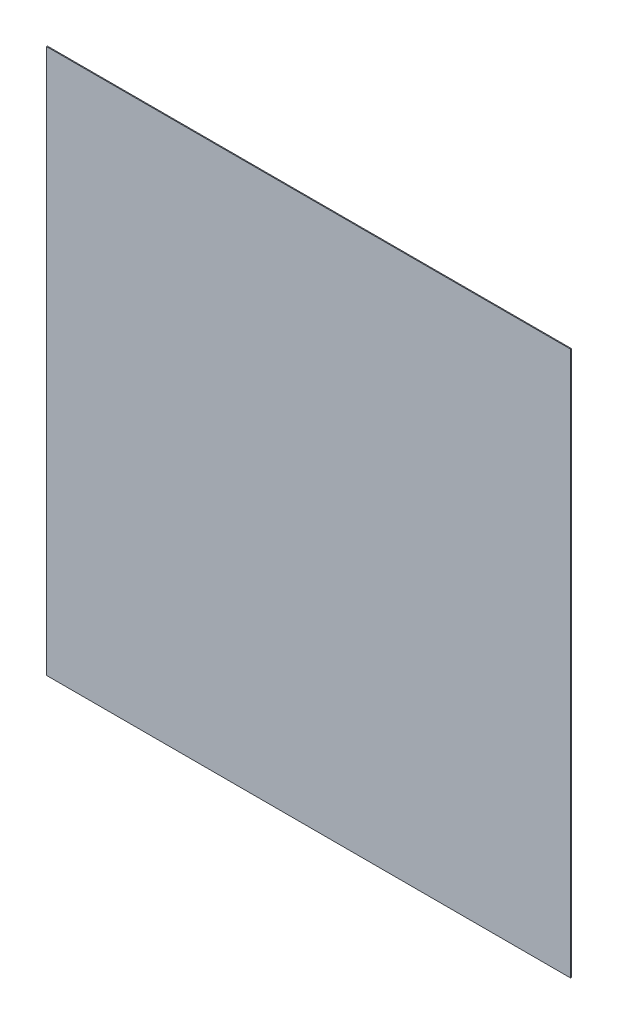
ISO-10303-21;
HEADER;
FILE_DESCRIPTION(('STEP AP214'),'2;1');
FILE_NAME('part.step','',(''),(''),'','','');
FILE_SCHEMA(('AUTOMOTIVE_DESIGN { 1 0 10303 214 1 1 1 1 }'));
ENDSEC;
DATA;
#1=APPLICATION_CONTEXT('core data for automotive mechanical design processes');
#2=APPLICATION_PROTOCOL_DEFINITION('international standard','automotive_design',2000,#1);
#3=PRODUCT_CONTEXT('',#1,'mechanical');
#4=PRODUCT('Part','Part','',(#3));
#5=PRODUCT_RELATED_PRODUCT_CATEGORY('part','',(#4));
#6=PRODUCT_DEFINITION_FORMATION('','',#4);
#7=PRODUCT_DEFINITION_CONTEXT('part definition',#1,'design');
#8=PRODUCT_DEFINITION('design','',#6,#7);
#9=PRODUCT_DEFINITION_SHAPE('','',#8);
#10=(LENGTH_UNIT() NAMED_UNIT(*) SI_UNIT(.MILLI.,.METRE.));
#11=(NAMED_UNIT(*) PLANE_ANGLE_UNIT() SI_UNIT($,.RADIAN.));
#12=(NAMED_UNIT(*) SI_UNIT($,.STERADIAN.) SOLID_ANGLE_UNIT());
#13=UNCERTAINTY_MEASURE_WITH_UNIT(LENGTH_MEASURE(1.E-05),#10,'distance_accuracy_value','');
#14=(GEOMETRIC_REPRESENTATION_CONTEXT(3) GLOBAL_UNCERTAINTY_ASSIGNED_CONTEXT((#13)) GLOBAL_UNIT_ASSIGNED_CONTEXT((#10,
#11,#12)) REPRESENTATION_CONTEXT('',''));
#15=CARTESIAN_POINT('',(0.,0.,0.));
#16=DIRECTION('',(0.,0.,1.));
#17=DIRECTION('',(1.,0.,0.));
#18=AXIS2_PLACEMENT_3D('',#15,#16,#17);
#19=CARTESIAN_POINT('',(0.,0.,4.));
#20=DIRECTION('',(1.,0.,0.));
#21=DIRECTION('',(0.,0.,-1.));
#22=AXIS2_PLACEMENT_3D('',#19,#20,#21);
#23=PLANE('',#22);
#24=DIRECTION('',(0.,-1.,0.));
#25=VECTOR('',#24,1.);
#26=CARTESIAN_POINT('',(0.,0.,0.));
#27=LINE('',#26,#25);
#28=CARTESIAN_POINT('',(0.,2390.,0.));
#29=VERTEX_POINT('',#28);
#30=CARTESIAN_POINT('',(0.,0.,0.));
#31=VERTEX_POINT('',#30);
#32=EDGE_CURVE('E113',#29,#31,#27,.T.);
#33=ORIENTED_EDGE('',*,*,#32,.T.);
#34=DIRECTION('',(0.,0.,-1.));
#35=VECTOR('',#34,1.);
#36=CARTESIAN_POINT('',(0.,0.,4.));
#37=LINE('',#36,#35);
#38=CARTESIAN_POINT('',(0.,0.,4.));
#39=VERTEX_POINT('',#38);
#40=EDGE_CURVE('E11',#39,#31,#37,.T.);
#41=ORIENTED_EDGE('',*,*,#40,.F.);
#42=DIRECTION('',(0.,-1.,0.));
#43=VECTOR('',#42,1.);
#44=CARTESIAN_POINT('',(0.,0.,4.));
#45=LINE('',#44,#43);
#46=CARTESIAN_POINT('',(0.,2390.,4.));
#47=VERTEX_POINT('',#46);
#48=EDGE_CURVE('E96',#47,#39,#45,.T.);
#49=ORIENTED_EDGE('',*,*,#48,.F.);
#50=DIRECTION('',(0.,0.,-1.));
#51=VECTOR('',#50,1.);
#52=CARTESIAN_POINT('',(0.,2390.,4.));
#53=LINE('',#52,#51);
#54=EDGE_CURVE('E109',#47,#29,#53,.T.);
#55=ORIENTED_EDGE('',*,*,#54,.T.);
#56=EDGE_LOOP('',(#33,#41,#49,#55));
#57=FACE_BOUND('',#56,.T.);
#58=ADVANCED_FACE('F39',(#57),#23,.F.);
#59=CARTESIAN_POINT('',(0.,0.,4.));
#60=DIRECTION('',(0.,1.,0.));
#61=DIRECTION('',(0.,0.,1.));
#62=AXIS2_PLACEMENT_3D('',#59,#60,#61);
#63=PLANE('',#62);
#64=DIRECTION('',(1.,0.,0.));
#65=VECTOR('',#64,1.);
#66=CARTESIAN_POINT('',(0.,0.,0.));
#67=LINE('',#66,#65);
#68=CARTESIAN_POINT('',(2300.,0.,0.));
#69=VERTEX_POINT('',#68);
#70=EDGE_CURVE('E101',#31,#69,#67,.T.);
#71=ORIENTED_EDGE('',*,*,#70,.T.);
#72=DIRECTION('',(0.,0.,-1.));
#73=VECTOR('',#72,1.);
#74=CARTESIAN_POINT('',(2300.,0.,4.));
#75=LINE('',#74,#73);
#76=CARTESIAN_POINT('',(2300.,0.,4.));
#77=VERTEX_POINT('',#76);
#78=EDGE_CURVE('E47',#77,#69,#75,.T.);
#79=ORIENTED_EDGE('',*,*,#78,.F.);
#80=DIRECTION('',(1.,0.,0.));
#81=VECTOR('',#80,1.);
#82=CARTESIAN_POINT('',(0.,0.,4.));
#83=LINE('',#82,#81);
#84=EDGE_CURVE('E91',#39,#77,#83,.T.);
#85=ORIENTED_EDGE('',*,*,#84,.F.);
#86=ORIENTED_EDGE('',*,*,#40,.T.);
#87=EDGE_LOOP('',(#71,#79,#85,#86));
#88=FACE_BOUND('',#87,.T.);
#89=ADVANCED_FACE('F100',(#88),#63,.F.);
#90=CARTESIAN_POINT('',(2300.,0.,4.));
#91=DIRECTION('',(-1.,0.,0.));
#92=DIRECTION('',(0.,0.,1.));
#93=AXIS2_PLACEMENT_3D('',#90,#91,#92);
#94=PLANE('',#93);
#95=DIRECTION('',(0.,1.,0.));
#96=VECTOR('',#95,1.);
#97=CARTESIAN_POINT('',(2300.,0.,0.));
#98=LINE('',#97,#96);
#99=CARTESIAN_POINT('',(2300.,2390.,0.));
#100=VERTEX_POINT('',#99);
#101=EDGE_CURVE('E77',#69,#100,#98,.T.);
#102=ORIENTED_EDGE('',*,*,#101,.T.);
#103=DIRECTION('',(0.,0.,-1.));
#104=VECTOR('',#103,1.);
#105=CARTESIAN_POINT('',(2300.,2390.,4.));
#106=LINE('',#105,#104);
#107=CARTESIAN_POINT('',(2300.,2390.,4.));
#108=VERTEX_POINT('',#107);
#109=EDGE_CURVE('E103',#108,#100,#106,.T.);
#110=ORIENTED_EDGE('',*,*,#109,.F.);
#111=DIRECTION('',(0.,1.,0.));
#112=VECTOR('',#111,1.);
#113=CARTESIAN_POINT('',(2300.,0.,4.));
#114=LINE('',#113,#112);
#115=EDGE_CURVE('E94',#77,#108,#114,.T.);
#116=ORIENTED_EDGE('',*,*,#115,.F.);
#117=ORIENTED_EDGE('',*,*,#78,.T.);
#118=EDGE_LOOP('',(#102,#110,#116,#117));
#119=FACE_BOUND('',#118,.T.);
#120=ADVANCED_FACE('F104',(#119),#94,.F.);
#121=CARTESIAN_POINT('',(0.,2390.,4.));
#122=DIRECTION('',(0.,-1.,0.));
#123=DIRECTION('',(0.,0.,-1.));
#124=AXIS2_PLACEMENT_3D('',#121,#122,#123);
#125=PLANE('',#124);
#126=DIRECTION('',(-1.,0.,0.));
#127=VECTOR('',#126,1.);
#128=CARTESIAN_POINT('',(0.,2390.,0.));
#129=LINE('',#128,#127);
#130=EDGE_CURVE('E84',#100,#29,#129,.T.);
#131=ORIENTED_EDGE('',*,*,#130,.T.);
#132=ORIENTED_EDGE('',*,*,#54,.F.);
#133=DIRECTION('',(-1.,0.,0.));
#134=VECTOR('',#133,1.);
#135=CARTESIAN_POINT('',(0.,2390.,4.));
#136=LINE('',#135,#134);
#137=EDGE_CURVE('E57',#108,#47,#136,.T.);
#138=ORIENTED_EDGE('',*,*,#137,.F.);
#139=ORIENTED_EDGE('',*,*,#109,.T.);
#140=EDGE_LOOP('',(#131,#132,#138,#139));
#141=FACE_BOUND('',#140,.T.);
#142=ADVANCED_FACE('F125',(#141),#125,.F.);
#143=CARTESIAN_POINT('',(0.,0.,4.));
#144=DIRECTION('',(0.,0.,-1.));
#145=DIRECTION('',(-1.,0.,0.));
#146=AXIS2_PLACEMENT_3D('',#143,#144,#145);
#147=PLANE('',#146);
#148=ORIENTED_EDGE('',*,*,#48,.T.);
#149=ORIENTED_EDGE('',*,*,#84,.T.);
#150=ORIENTED_EDGE('',*,*,#115,.T.);
#151=ORIENTED_EDGE('',*,*,#137,.T.);
#152=EDGE_LOOP('',(#148,#149,#150,#151));
#153=FACE_BOUND('',#152,.T.);
#154=ADVANCED_FACE('F92',(#153),#147,.F.);
#155=CARTESIAN_POINT('',(0.,0.,0.));
#156=DIRECTION('',(0.,0.,-1.));
#157=DIRECTION('',(-1.,0.,0.));
#158=AXIS2_PLACEMENT_3D('',#155,#156,#157);
#159=PLANE('',#158);
#160=ORIENTED_EDGE('',*,*,#32,.F.);
#161=ORIENTED_EDGE('',*,*,#130,.F.);
#162=ORIENTED_EDGE('',*,*,#101,.F.);
#163=ORIENTED_EDGE('',*,*,#70,.F.);
#164=EDGE_LOOP('',(#160,#161,#162,#163));
#165=FACE_BOUND('',#164,.T.);
#166=ADVANCED_FACE('F128',(#165),#159,.T.);
#167=CLOSED_SHELL('',(#58,#89,#120,#142,#154,#166));
#168=MANIFOLD_SOLID_BREP('B2',#167);
#169=ADVANCED_BREP_SHAPE_REPRESENTATION('',(#18,#168),#14);
#170=SHAPE_DEFINITION_REPRESENTATION(#9,#169);
ENDSEC;
END-ISO-10303-21;
